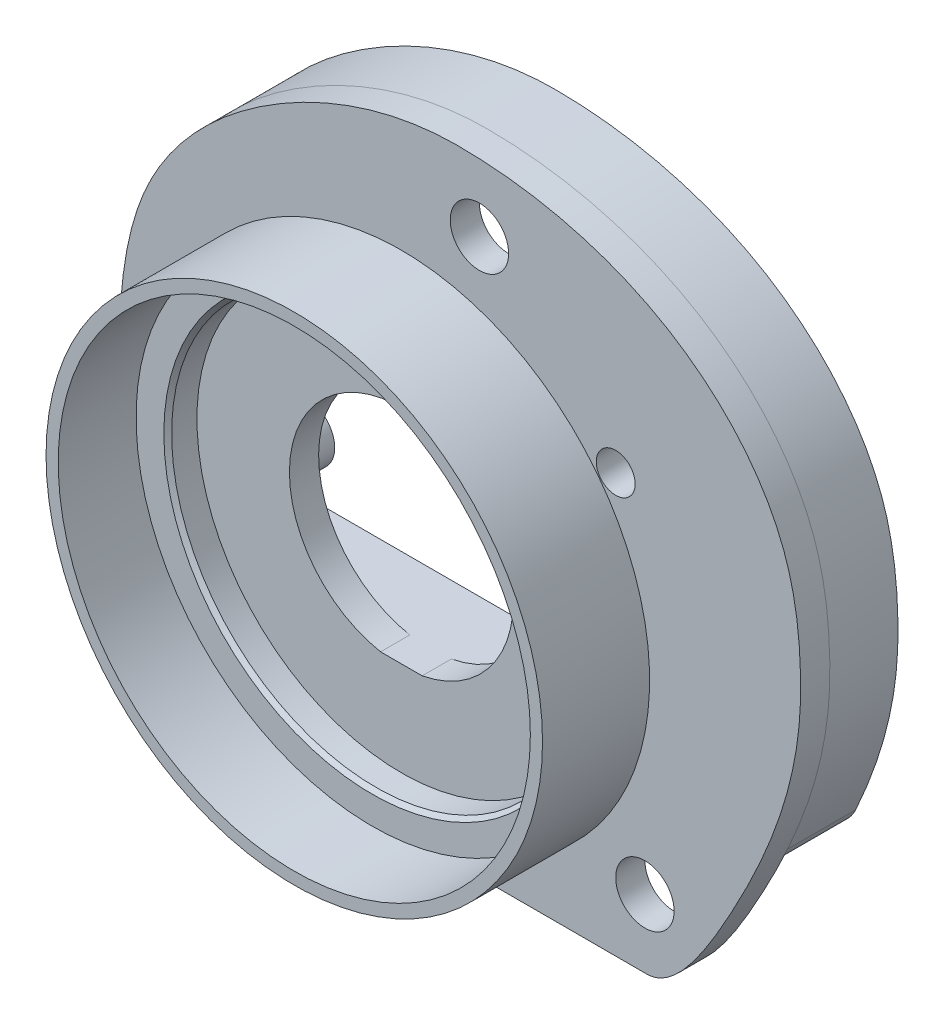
from build123d import *

# Parameters (mm, degrees)
ESQUISSE1_R             = 1.5
ESQUISSE1_R_2           = 1
EXTRUSION1_DEPTH        = 1.5
EXTRUSION2_DEPTH        = 3.5
ENL_V_MAT_EXTRU_1_DEPTH = 3.5
ESQUISSE4_R             = 12.75
ESQUISSE4_R_2           = 10.5
EXTRUSION3_DEPTH        = 1.5
ESQUISSE5_R             = 12.75
ESQUISSE5_R_2           = 12.125
EXTRUSION4_DEPTH        = 5.5
ESQUISSE6_R             = 1.5
EXTRUSION5_DEPTH        = 4.6
ESQUISSE7_R             = 1.5
EXTRUSION6_DEPTH        = 2.2
ESQUISSE7_3_R           = 1.5
EXTRUSION7_DEPTH        = 0.5
ESQUISSE8_R             = 0.85
EXTRUSION8_DEPTH        = 5.1
ESQUISSE8_3_R           = 0.85
EXTRUSION9_DEPTH        = 3.5
CHANFREIN1_SIZE         = 0.2
EXTRUSION10_DEPTH       = 4


with BuildPart() as part:
    # Esquisse1 → Extrusion1 (new body)
    with BuildSketch(Plane.XY):
        with BuildLine():
            add(Edge.make_bspline(
                [(-3.3971797, 11.394071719), (-3.395513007, 8.68662854), (-2.370480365, 4.05510623), (0.54355257, -2.679105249), (9.441377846, -2.667372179), (18.848986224, -2.667372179), (25.131099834, -2.678468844), (29.726189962, 4.570315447), (31.606721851, 10.113449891), (31.601256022, 15.563967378), (31.227270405, 20.572792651), (25.267008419, 27.659845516), (17.9103775, 29.32863948), (10.672863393, 29.320243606), (4.099449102, 27.082365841), (-2.82924192, 20.180658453), (-3.398796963, 14.021218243), (-3.3971797, 11.394071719)],
                knots=[0, 0, 0, 0, 0.075095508, 0.145707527, 0.145707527, 0.335877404, 0.335877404, 0.392344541, 0.508788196, 0.508788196, 0.555474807, 0.636980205, 0.746884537, 0.746884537, 0.838992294, 0.927131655, 1, 1, 1, 1], degree=3))
        make_face()
        with Locations((15.1028203, 25.824071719)):
            Circle(ESQUISSE1_R, mode=Mode.SUBTRACT)
        with Locations((22.1028203, 18.824071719)):
            Circle(ESQUISSE1_R_2, mode=Mode.SUBTRACT)
        with Locations((23.6028203, 0.824071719)):
            Circle(ESQUISSE1_R, mode=Mode.SUBTRACT)
    extrude(amount=-EXTRUSION1_DEPTH)

    # Esquisse2 → Extrusion2 (add)
    with BuildSketch(Plane(origin=(0, 0, -1.5), x_dir=(-1, 0, 0), z_dir=(0, 0, -1))):
        with BuildLine():
            ThreePointArc((-29.426982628, 4.996258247), (-28.689019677, 4.142461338), (-27.606344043, 3.824071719))
            Line((-27.606344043, 3.824071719), (0.534966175, 3.824071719))
            ThreePointArc((0.534966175, 3.824071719), (1.733661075, 4.223093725), (2.454050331, 5.260941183))
            add(Edge.make_bspline(
                [(2.454050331, 5.260941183), (3.077640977, 7.386066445), (3.395886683, 9.293643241), (3.3971797, 11.394071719)],
                knots=[0.941741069, 0.941741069, 0.941741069, 0.941741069, 1, 1, 1, 1], degree=3))
            add(Edge.make_bspline(
                [(3.3971797, 11.394071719), (3.398796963, 14.021218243), (2.82924192, 20.180658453), (-4.099449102, 27.082365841), (-10.672863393, 29.320243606), (-17.9103775, 29.32863948), (-25.267008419, 27.659845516), (-31.227270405, 20.572792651), (-31.601256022, 15.563967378), (-31.605785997, 11.046682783), (-30.874763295, 8.180411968), (-29.426982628, 4.996258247)],
                knots=[1, 1, 1, 1, 1.072868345, 1.161007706, 1.253115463, 1.253115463, 1.363019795, 1.444525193, 1.491211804, 1.491211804, 1.579724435, 1.579724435, 1.579724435, 1.579724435], degree=3))
        make_face()
        with BuildLine():
            Line((0.534966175, 4.824071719), (-27.606344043, 4.824071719))
            ThreePointArc((-27.606344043, 4.824071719), (-28.14768186, 4.983266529), (-28.516663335, 5.410164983))
            add(Edge.make_bspline(
                [(1.494508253, 5.542506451), (1.595317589, 5.886053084), (1.787642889, 6.587899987), (2.09094384, 7.917663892), (2.344077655, 9.542227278), (2.422397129, 11.531792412), (2.32309957, 14.398035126), (1.782093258, 17.858286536), (-0.064606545, 21.393226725), (-3.0583952, 24.3711127), (-6.734876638, 26.675611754), (-10.054210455, 27.878785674), (-12.737228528, 28.316987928), (-15.420569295, 28.351546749), (-18.96495247, 27.92462977), (-22.987467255, 26.578602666), (-26.522941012, 24.304922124), (-28.767929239, 21.652395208), (-29.919085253, 19.211855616), (-30.411831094, 17.200809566), (-30.576335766, 15.443602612), (-30.609458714, 14.108094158), (-30.574940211, 12.244634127), (-30.22292042, 10.06062662), (-29.496505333, 7.786140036), (-28.975016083, 6.449248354), (-28.671838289, 5.751446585), (-28.516663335, 5.410164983)],
                knots=[0.941741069, 0.941741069, 0.941741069, 0.941741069, 0.951709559, 0.96167805, 0.98161503, 1.00155201, 1.02148899, 1.06136295, 1.101236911, 1.141110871, 1.180984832, 1.220858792, 1.240795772, 1.260732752, 1.300606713, 1.340480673, 1.380354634, 1.420228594, 1.440165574, 1.460102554, 1.480039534, 1.490008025, 1.499976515, 1.539850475, 1.559787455, 1.569755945, 1.579724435, 1.579724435, 1.579724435, 1.579724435], degree=3))
            ThreePointArc((1.494508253, 5.542506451), (1.134313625, 5.023582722), (0.534966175, 4.824071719))
        make_face(mode=Mode.SUBTRACT)
    extrude(amount=EXTRUSION2_DEPTH)

    # Esquisse3 → Enl_v. mat.-Extru.1 (cut)
    with BuildSketch(Plane.XY):
        with BuildLine():
            Line((12.161973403, 4.824071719), (10.026557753, 4.824071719))
            ThreePointArc((10.026557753, 4.824071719), (11.094265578, 16.224071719), (12.161973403, 4.824071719))
        make_face()
    extrude(amount=-ENL_V_MAT_EXTRU_1_DEPTH, mode=Mode.SUBTRACT)

    # Esquisse4 → Extrusion3 (add)
    with BuildSketch(Plane.XY):
        with Locations(Location((11.094265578, 10.474071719, 0), (0, 0, 180))):
            Circle(ESQUISSE4_R)
        with Locations((11.094265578, 10.474071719)):
            Circle(ESQUISSE4_R_2, mode=Mode.SUBTRACT)
    extrude(amount=EXTRUSION3_DEPTH)

    # Esquisse5 → Extrusion4 (add)
    with BuildSketch(Plane.XY):
        with Locations(Location((11.094265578, 10.474071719, 0), (0, 0, 180))):
            Circle(ESQUISSE5_R)
        with Locations((11.094265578, 10.474071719)):
            Circle(ESQUISSE5_R_2, mode=Mode.SUBTRACT)
    extrude(amount=EXTRUSION4_DEPTH)

    # Esquisse6 → Extrusion5 (add)
    with BuildSketch(Plane(origin=(0, 0, -1.5), x_dir=(-1, 0, 0), z_dir=(0, 0, -1))):
        with Locations((-0.07081874, 6.624071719)):
            Circle(ESQUISSE6_R)
        with Locations((-8.473809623, 25.324071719)):
            Circle(ESQUISSE6_R)
        with Locations((-27.086630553, 6.624071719)):
            Circle(ESQUISSE6_R)
    extrude(amount=EXTRUSION5_DEPTH)

    # Esquisse7 → Extrusion6 (add)
    with BuildSketch(Plane(origin=(0, 0, -1.5), x_dir=(-1, 0, 0), z_dir=(0, 0, -1))):
        with Locations((-14.165566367, 17.824071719)):
            Circle(ESQUISSE7_R)
    extrude(amount=EXTRUSION6_DEPTH)

    # Esquisse7_3 → Extrusion7 (add)
    with BuildSketch(Plane(origin=(0, 0, -1.5), x_dir=(-1, 0, 0), z_dir=(0, 0, -1))):
        with Locations((-14.165566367, 17.824071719)):
            Circle(ESQUISSE7_3_R)
        with Locations((-6.228312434, 16.824071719)):
            Circle(ESQUISSE7_3_R)
    extrude(amount=EXTRUSION7_DEPTH)

    # Esquisse8 → Extrusion8 (add)
    with BuildSketch(Plane(origin=(0, 0, -1.5), x_dir=(-1, 0, 0), z_dir=(0, 0, -1))):
        with Locations((-14.165566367, 17.824071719)):
            Circle(ESQUISSE8_R)
    extrude(amount=EXTRUSION8_DEPTH)

    # Esquisse8_3 → Extrusion9 (add)
    with BuildSketch(Plane(origin=(0, 0, -1.5), x_dir=(-1, 0, 0), z_dir=(0, 0, -1))):
        with Locations((-14.165566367, 17.824071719)):
            Circle(ESQUISSE8_3_R)
        with Locations((-6.228312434, 16.824071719)):
            Circle(ESQUISSE8_3_R)
    extrude(amount=EXTRUSION9_DEPTH)

    # Chanfrein1
    chanfrein1_edges = [part.edges().sort_by_distance(p)[0] for p in [
        (0.594265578, 10.474071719, 1.5),
    ]]
    chamfer(chanfrein1_edges, length=CHANFREIN1_SIZE)

    # Esquisse2_3 → Extrusion10 (add)
    with BuildSketch(Plane(origin=(0, 0, -1.5), x_dir=(-1, 0, 0), z_dir=(0, 0, -1))):
        with BuildLine():
            ThreePointArc((-21.880650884, 17.849063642), (-23.084351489, 19.015373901), (-21.530759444, 19.644282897))
            Line((-21.530759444, 19.644282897), (-21.0228203, 20.854736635))
            ThreePointArc((-21.0228203, 20.854736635), (-24.4028203, 18.824071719), (-21.0228203, 16.793406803))
            Line((-21.0228203, 16.793406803), (-21.880650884, 17.849063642))
        make_face()
    extrude(amount=EXTRUSION10_DEPTH)


solid = part.part
